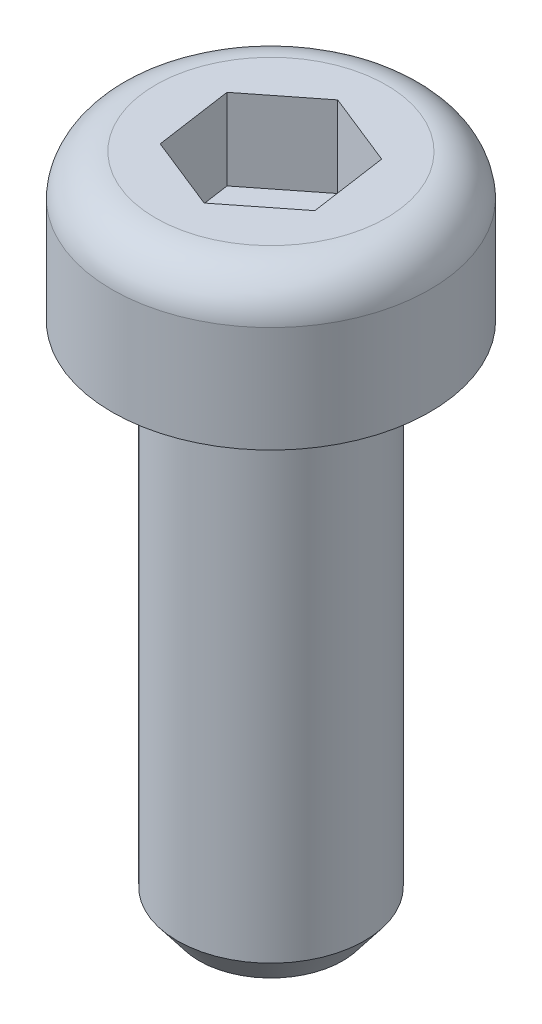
ISO-10303-21;
HEADER;
FILE_DESCRIPTION(('STEP AP214'),'2;1');
FILE_NAME('part.step','',(''),(''),'','','');
FILE_SCHEMA(('AUTOMOTIVE_DESIGN { 1 0 10303 214 1 1 1 1 }'));
ENDSEC;
DATA;
#1=APPLICATION_CONTEXT('core data for automotive mechanical design processes');
#2=APPLICATION_PROTOCOL_DEFINITION('international standard','automotive_design',2000,#1);
#3=PRODUCT_CONTEXT('',#1,'mechanical');
#4=PRODUCT('Part','Part','',(#3));
#5=PRODUCT_RELATED_PRODUCT_CATEGORY('part','',(#4));
#6=PRODUCT_DEFINITION_FORMATION('','',#4);
#7=PRODUCT_DEFINITION_CONTEXT('part definition',#1,'design');
#8=PRODUCT_DEFINITION('design','',#6,#7);
#9=PRODUCT_DEFINITION_SHAPE('','',#8);
#10=(LENGTH_UNIT() NAMED_UNIT(*) SI_UNIT(.MILLI.,.METRE.));
#11=(NAMED_UNIT(*) PLANE_ANGLE_UNIT() SI_UNIT($,.RADIAN.));
#12=(NAMED_UNIT(*) SI_UNIT($,.STERADIAN.) SOLID_ANGLE_UNIT());
#13=UNCERTAINTY_MEASURE_WITH_UNIT(LENGTH_MEASURE(1.E-05),#10,'distance_accuracy_value','');
#14=(GEOMETRIC_REPRESENTATION_CONTEXT(3) GLOBAL_UNCERTAINTY_ASSIGNED_CONTEXT((#13)) GLOBAL_UNIT_ASSIGNED_CONTEXT((#10,
#11,#12)) REPRESENTATION_CONTEXT('',''));
#15=CARTESIAN_POINT('',(0.,0.,0.));
#16=DIRECTION('',(0.,0.,1.));
#17=DIRECTION('',(1.,0.,0.));
#18=AXIS2_PLACEMENT_3D('',#15,#16,#17);
#19=CARTESIAN_POINT('',(-4.42696025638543,-31.9873831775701,0.));
#20=DIRECTION('',(0.,-1.,0.));
#21=DIRECTION('',(0.,0.,-1.));
#22=AXIS2_PLACEMENT_3D('',#19,#20,#21);
#23=PLANE('',#22);
#24=CARTESIAN_POINT('',(0.,-31.9873831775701,0.));
#25=DIRECTION('',(0.,1.,0.));
#26=DIRECTION('',(0.,0.,1.));
#27=AXIS2_PLACEMENT_3D('',#24,#25,#26);
#28=CIRCLE('',#27,4.42696025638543);
#29=CARTESIAN_POINT('',(0.,-31.9873831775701,4.42696025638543));
#30=VERTEX_POINT('',#29);
#31=EDGE_CURVE('E140',#30,#30,#28,.T.);
#32=ORIENTED_EDGE('',*,*,#31,.F.);
#33=EDGE_LOOP('',(#32));
#34=FACE_BOUND('',#33,.T.);
#35=ADVANCED_FACE('F33',(#34),#23,.T.);
#36=CARTESIAN_POINT('',(-1.53173837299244,9.01962904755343,0.));
#37=DIRECTION('',(0.,1.,0.));
#38=DIRECTION('',(0.,0.,1.));
#39=AXIS2_PLACEMENT_3D('',#36,#37,#38);
#40=PLANE('',#39);
#41=DIRECTION('',(-0.928499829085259,0.,-0.37133282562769));
#42=VECTOR('',#41,1.);
#43=CARTESIAN_POINT('',(3.82069582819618,9.01962904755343,-3.00682442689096));
#44=LINE('',#43,#42);
#45=CARTESIAN_POINT('',(3.82069582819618,9.01962904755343,-3.00682442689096));
#46=VERTEX_POINT('',#45);
#47=CARTESIAN_POINT('',(-0.693638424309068,9.01962904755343,-4.81223186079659));
#48=VERTEX_POINT('',#47);
#49=EDGE_CURVE('E48',#46,#48,#44,.T.);
#50=ORIENTED_EDGE('',*,*,#49,.F.);
#51=DIRECTION('',(-0.142666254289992,0.,-0.989770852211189));
#52=VECTOR('',#51,1.);
#53=CARTESIAN_POINT('',(4.51433425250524,9.01962904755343,1.80540743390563));
#54=LINE('',#53,#52);
#55=CARTESIAN_POINT('',(4.51433425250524,9.01962904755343,1.80540743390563));
#56=VERTEX_POINT('',#55);
#57=EDGE_CURVE('E131',#56,#46,#54,.T.);
#58=ORIENTED_EDGE('',*,*,#57,.F.);
#59=DIRECTION('',(0.785833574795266,0.,-0.618438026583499));
#60=VECTOR('',#59,1.);
#61=CARTESIAN_POINT('',(0.693638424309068,9.01962904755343,4.81223186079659));
#62=LINE('',#61,#60);
#63=CARTESIAN_POINT('',(0.693638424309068,9.01962904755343,4.81223186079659));
#64=VERTEX_POINT('',#63);
#65=EDGE_CURVE('E129',#64,#56,#62,.T.);
#66=ORIENTED_EDGE('',*,*,#65,.F.);
#67=DIRECTION('',(0.928499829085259,0.,0.37133282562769));
#68=VECTOR('',#67,1.);
#69=CARTESIAN_POINT('',(-3.82069582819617,9.01962904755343,3.00682442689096));
#70=LINE('',#69,#68);
#71=CARTESIAN_POINT('',(-3.82069582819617,9.01962904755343,3.00682442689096));
#72=VERTEX_POINT('',#71);
#73=EDGE_CURVE('E96',#72,#64,#70,.T.);
#74=ORIENTED_EDGE('',*,*,#73,.F.);
#75=DIRECTION('',(0.142666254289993,0.,0.989770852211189));
#76=VECTOR('',#75,1.);
#77=CARTESIAN_POINT('',(-4.51433425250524,9.01962904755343,-1.80540743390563));
#78=LINE('',#77,#76);
#79=CARTESIAN_POINT('',(-4.51433425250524,9.01962904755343,-1.80540743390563));
#80=VERTEX_POINT('',#79);
#81=EDGE_CURVE('E125',#80,#72,#78,.T.);
#82=ORIENTED_EDGE('',*,*,#81,.F.);
#83=DIRECTION('',(-0.785833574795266,0.,0.618438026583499));
#84=VECTOR('',#83,1.);
#85=CARTESIAN_POINT('',(-0.693638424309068,9.01962904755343,-4.81223186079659));
#86=LINE('',#85,#84);
#87=EDGE_CURVE('E122',#48,#80,#86,.T.);
#88=ORIENTED_EDGE('',*,*,#87,.F.);
#89=EDGE_LOOP('',(#50,#58,#66,#74,#82,#88));
#90=FACE_BOUND('',#89,.T.);
#91=CARTESIAN_POINT('',(0.,9.01962904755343,0.));
#92=DIRECTION('',(0.,1.,0.));
#93=DIRECTION('',(0.,0.,1.));
#94=AXIS2_PLACEMENT_3D('',#91,#92,#93);
#95=CIRCLE('',#94,7.11197760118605);
#96=CARTESIAN_POINT('',(0.,9.01962904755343,7.11197760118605));
#97=VERTEX_POINT('',#96);
#98=EDGE_CURVE('E41',#97,#97,#95,.T.);
#99=ORIENTED_EDGE('',*,*,#98,.T.);
#100=EDGE_LOOP('',(#99));
#101=FACE_BOUND('',#100,.T.);
#102=ADVANCED_FACE('F158',(#90,#101),#40,.T.);
#103=CARTESIAN_POINT('',(0.,6.32600587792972,0.));
#104=DIRECTION('',(0.,1.,0.));
#105=DIRECTION('',(0.,0.,1.));
#106=AXIS2_PLACEMENT_3D('',#103,#104,#105);
#107=TOROIDAL_SURFACE('',#106,7.11197760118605,2.6936231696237);
#108=CARTESIAN_POINT('',(0.,6.5411514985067,0.));
#109=DIRECTION('',(0.,1.,0.));
#110=DIRECTION('',(0.,0.,1.));
#111=AXIS2_PLACEMENT_3D('',#108,#109,#110);
#112=CIRCLE('',#111,9.79699494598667);
#113=CARTESIAN_POINT('',(0.,6.5411514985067,9.79699494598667));
#114=VERTEX_POINT('',#113);
#115=EDGE_CURVE('E152',#114,#114,#112,.T.);
#116=ORIENTED_EDGE('',*,*,#115,.T.);
#117=EDGE_LOOP('',(#116));
#118=FACE_BOUND('',#117,.T.);
#119=ORIENTED_EDGE('',*,*,#98,.F.);
#120=EDGE_LOOP('',(#119));
#121=FACE_BOUND('',#120,.T.);
#122=ADVANCED_FACE('F160',(#118,#121),#107,.T.);
#123=CARTESIAN_POINT('',(0.,0.,0.));
#124=DIRECTION('',(0.,1.,0.));
#125=DIRECTION('',(0.,0.,1.));
#126=AXIS2_PLACEMENT_3D('',#123,#124,#125);
#127=CYLINDRICAL_SURFACE('',#126,9.79699494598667);
#128=CARTESIAN_POINT('',(0.,0.,0.));
#129=DIRECTION('',(0.,1.,0.));
#130=DIRECTION('',(0.,0.,1.));
#131=AXIS2_PLACEMENT_3D('',#128,#129,#130);
#132=CIRCLE('',#131,9.79699494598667);
#133=CARTESIAN_POINT('',(0.,0.,9.79699494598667));
#134=VERTEX_POINT('',#133);
#135=EDGE_CURVE('E149',#134,#134,#132,.T.);
#136=ORIENTED_EDGE('',*,*,#135,.T.);
#137=EDGE_LOOP('',(#136));
#138=FACE_BOUND('',#137,.T.);
#139=ORIENTED_EDGE('',*,*,#115,.F.);
#140=EDGE_LOOP('',(#139));
#141=FACE_BOUND('',#140,.T.);
#142=ADVANCED_FACE('F162',(#138,#141),#127,.T.);
#143=CARTESIAN_POINT('',(-9.79699494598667,0.,0.));
#144=DIRECTION('',(0.,-1.,0.));
#145=DIRECTION('',(0.,0.,-1.));
#146=AXIS2_PLACEMENT_3D('',#143,#144,#145);
#147=PLANE('',#146);
#148=CARTESIAN_POINT('',(0.,0.,0.));
#149=DIRECTION('',(0.,1.,0.));
#150=DIRECTION('',(0.,0.,1.));
#151=AXIS2_PLACEMENT_3D('',#148,#149,#150);
#152=CIRCLE('',#151,5.76946892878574);
#153=CARTESIAN_POINT('',(0.,0.,5.76946892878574));
#154=VERTEX_POINT('',#153);
#155=EDGE_CURVE('E146',#154,#154,#152,.T.);
#156=ORIENTED_EDGE('',*,*,#155,.T.);
#157=EDGE_LOOP('',(#156));
#158=FACE_BOUND('',#157,.T.);
#159=ORIENTED_EDGE('',*,*,#135,.F.);
#160=EDGE_LOOP('',(#159));
#161=FACE_BOUND('',#160,.T.);
#162=ADVANCED_FACE('F169',(#158,#161),#147,.T.);
#163=CARTESIAN_POINT('',(0.,0.,0.));
#164=DIRECTION('',(0.,1.,0.));
#165=DIRECTION('',(0.,0.,1.));
#166=AXIS2_PLACEMENT_3D('',#163,#164,#165);
#167=CYLINDRICAL_SURFACE('',#166,5.76946892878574);
#168=CARTESIAN_POINT('',(0.,-30.2465732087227,0.));
#169=DIRECTION('',(0.,1.,0.));
#170=DIRECTION('',(0.,0.,1.));
#171=AXIS2_PLACEMENT_3D('',#168,#169,#170);
#172=CIRCLE('',#171,5.76946892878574);
#173=CARTESIAN_POINT('',(0.,-30.2465732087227,5.76946892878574));
#174=VERTEX_POINT('',#173);
#175=EDGE_CURVE('E143',#174,#174,#172,.T.);
#176=ORIENTED_EDGE('',*,*,#175,.T.);
#177=EDGE_LOOP('',(#176));
#178=FACE_BOUND('',#177,.T.);
#179=ORIENTED_EDGE('',*,*,#155,.F.);
#180=EDGE_LOOP('',(#179));
#181=FACE_BOUND('',#180,.T.);
#182=ADVANCED_FACE('F184',(#178,#181),#167,.T.);
#183=CARTESIAN_POINT('',(0.,-30.2465732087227,0.));
#184=DIRECTION('',(0.,1.,0.));
#185=DIRECTION('',(0.,0.,1.));
#186=AXIS2_PLACEMENT_3D('',#183,#184,#185);
#187=CONICAL_SURFACE('',#186,5.76946892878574,0.656930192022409);
#188=ORIENTED_EDGE('',*,*,#31,.T.);
#189=EDGE_LOOP('',(#188));
#190=FACE_BOUND('',#189,.T.);
#191=ORIENTED_EDGE('',*,*,#175,.F.);
#192=EDGE_LOOP('',(#191));
#193=FACE_BOUND('',#192,.T.);
#194=ADVANCED_FACE('F180',(#190,#193),#187,.T.);
#195=CARTESIAN_POINT('',(3.82069582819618,4.01962904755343,-3.00682442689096));
#196=DIRECTION('',(0.37133282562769,0.,-0.928499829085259));
#197=DIRECTION('',(-0.928499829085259,0.,-0.37133282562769));
#198=AXIS2_PLACEMENT_3D('',#195,#196,#197);
#199=PLANE('',#198);
#200=ORIENTED_EDGE('',*,*,#49,.T.);
#201=DIRECTION('',(0.,1.,0.));
#202=VECTOR('',#201,1.);
#203=CARTESIAN_POINT('',(-0.693638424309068,4.01962904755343,-4.81223186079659));
#204=LINE('',#203,#202);
#205=CARTESIAN_POINT('',(-0.693638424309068,4.01962904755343,-4.81223186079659));
#206=VERTEX_POINT('',#205);
#207=EDGE_CURVE('E78',#206,#48,#204,.T.);
#208=ORIENTED_EDGE('',*,*,#207,.F.);
#209=DIRECTION('',(-0.928499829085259,0.,-0.37133282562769));
#210=VECTOR('',#209,1.);
#211=CARTESIAN_POINT('',(3.82069582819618,4.01962904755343,-3.00682442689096));
#212=LINE('',#211,#210);
#213=CARTESIAN_POINT('',(3.82069582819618,4.01962904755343,-3.00682442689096));
#214=VERTEX_POINT('',#213);
#215=EDGE_CURVE('E133',#214,#206,#212,.T.);
#216=ORIENTED_EDGE('',*,*,#215,.F.);
#217=DIRECTION('',(0.,1.,0.));
#218=VECTOR('',#217,1.);
#219=CARTESIAN_POINT('',(3.82069582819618,4.01962904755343,-3.00682442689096));
#220=LINE('',#219,#218);
#221=EDGE_CURVE('E56',#214,#46,#220,.T.);
#222=ORIENTED_EDGE('',*,*,#221,.T.);
#223=EDGE_LOOP('',(#200,#208,#216,#222));
#224=FACE_BOUND('',#223,.T.);
#225=ADVANCED_FACE('F183',(#224),#199,.F.);
#226=CARTESIAN_POINT('',(4.51433425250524,4.01962904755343,1.80540743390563));
#227=DIRECTION('',(0.989770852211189,0.,-0.142666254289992));
#228=DIRECTION('',(-0.142666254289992,0.,-0.989770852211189));
#229=AXIS2_PLACEMENT_3D('',#226,#227,#228);
#230=PLANE('',#229);
#231=ORIENTED_EDGE('',*,*,#57,.T.);
#232=ORIENTED_EDGE('',*,*,#221,.F.);
#233=DIRECTION('',(-0.142666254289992,0.,-0.989770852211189));
#234=VECTOR('',#233,1.);
#235=CARTESIAN_POINT('',(4.51433425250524,4.01962904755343,1.80540743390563));
#236=LINE('',#235,#234);
#237=CARTESIAN_POINT('',(4.51433425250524,4.01962904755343,1.80540743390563));
#238=VERTEX_POINT('',#237);
#239=EDGE_CURVE('E108',#238,#214,#236,.T.);
#240=ORIENTED_EDGE('',*,*,#239,.F.);
#241=DIRECTION('',(0.,1.,0.));
#242=VECTOR('',#241,1.);
#243=CARTESIAN_POINT('',(4.51433425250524,4.01962904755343,1.80540743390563));
#244=LINE('',#243,#242);
#245=EDGE_CURVE('E100',#238,#56,#244,.T.);
#246=ORIENTED_EDGE('',*,*,#245,.T.);
#247=EDGE_LOOP('',(#231,#232,#240,#246));
#248=FACE_BOUND('',#247,.T.);
#249=ADVANCED_FACE('F204',(#248),#230,.F.);
#250=CARTESIAN_POINT('',(0.693638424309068,4.01962904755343,4.81223186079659));
#251=DIRECTION('',(0.618438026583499,0.,0.785833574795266));
#252=DIRECTION('',(0.785833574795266,0.,-0.618438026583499));
#253=AXIS2_PLACEMENT_3D('',#250,#251,#252);
#254=PLANE('',#253);
#255=ORIENTED_EDGE('',*,*,#65,.T.);
#256=ORIENTED_EDGE('',*,*,#245,.F.);
#257=DIRECTION('',(0.785833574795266,0.,-0.618438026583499));
#258=VECTOR('',#257,1.);
#259=CARTESIAN_POINT('',(0.693638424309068,4.01962904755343,4.81223186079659));
#260=LINE('',#259,#258);
#261=CARTESIAN_POINT('',(0.693638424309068,4.01962904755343,4.81223186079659));
#262=VERTEX_POINT('',#261);
#263=EDGE_CURVE('E104',#262,#238,#260,.T.);
#264=ORIENTED_EDGE('',*,*,#263,.F.);
#265=DIRECTION('',(0.,1.,0.));
#266=VECTOR('',#265,1.);
#267=CARTESIAN_POINT('',(0.693638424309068,4.01962904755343,4.81223186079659));
#268=LINE('',#267,#266);
#269=EDGE_CURVE('E89',#262,#64,#268,.T.);
#270=ORIENTED_EDGE('',*,*,#269,.T.);
#271=EDGE_LOOP('',(#255,#256,#264,#270));
#272=FACE_BOUND('',#271,.T.);
#273=ADVANCED_FACE('F105',(#272),#254,.F.);
#274=CARTESIAN_POINT('',(-3.82069582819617,4.01962904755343,3.00682442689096));
#275=DIRECTION('',(-0.37133282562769,0.,0.928499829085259));
#276=DIRECTION('',(0.928499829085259,0.,0.37133282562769));
#277=AXIS2_PLACEMENT_3D('',#274,#275,#276);
#278=PLANE('',#277);
#279=ORIENTED_EDGE('',*,*,#73,.T.);
#280=ORIENTED_EDGE('',*,*,#269,.F.);
#281=DIRECTION('',(0.928499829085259,0.,0.37133282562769));
#282=VECTOR('',#281,1.);
#283=CARTESIAN_POINT('',(-3.82069582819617,4.01962904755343,3.00682442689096));
#284=LINE('',#283,#282);
#285=CARTESIAN_POINT('',(-3.82069582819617,4.01962904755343,3.00682442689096));
#286=VERTEX_POINT('',#285);
#287=EDGE_CURVE('E93',#286,#262,#284,.T.);
#288=ORIENTED_EDGE('',*,*,#287,.F.);
#289=DIRECTION('',(0.,1.,0.));
#290=VECTOR('',#289,1.);
#291=CARTESIAN_POINT('',(-3.82069582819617,4.01962904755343,3.00682442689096));
#292=LINE('',#291,#290);
#293=EDGE_CURVE('E101',#286,#72,#292,.T.);
#294=ORIENTED_EDGE('',*,*,#293,.T.);
#295=EDGE_LOOP('',(#279,#280,#288,#294));
#296=FACE_BOUND('',#295,.T.);
#297=ADVANCED_FACE('F91',(#296),#278,.F.);
#298=CARTESIAN_POINT('',(-4.51433425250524,4.01962904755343,-1.80540743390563));
#299=DIRECTION('',(-0.989770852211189,0.,0.142666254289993));
#300=DIRECTION('',(0.142666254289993,0.,0.989770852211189));
#301=AXIS2_PLACEMENT_3D('',#298,#299,#300);
#302=PLANE('',#301);
#303=ORIENTED_EDGE('',*,*,#81,.T.);
#304=ORIENTED_EDGE('',*,*,#293,.F.);
#305=DIRECTION('',(0.142666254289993,0.,0.989770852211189));
#306=VECTOR('',#305,1.);
#307=CARTESIAN_POINT('',(-4.51433425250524,4.01962904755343,-1.80540743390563));
#308=LINE('',#307,#306);
#309=CARTESIAN_POINT('',(-4.51433425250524,4.01962904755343,-1.80540743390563));
#310=VERTEX_POINT('',#309);
#311=EDGE_CURVE('E114',#310,#286,#308,.T.);
#312=ORIENTED_EDGE('',*,*,#311,.F.);
#313=DIRECTION('',(0.,1.,0.));
#314=VECTOR('',#313,1.);
#315=CARTESIAN_POINT('',(-4.51433425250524,4.01962904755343,-1.80540743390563));
#316=LINE('',#315,#314);
#317=EDGE_CURVE('E137',#310,#80,#316,.T.);
#318=ORIENTED_EDGE('',*,*,#317,.T.);
#319=EDGE_LOOP('',(#303,#304,#312,#318));
#320=FACE_BOUND('',#319,.T.);
#321=ADVANCED_FACE('F208',(#320),#302,.F.);
#322=CARTESIAN_POINT('',(-0.693638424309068,4.01962904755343,-4.81223186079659));
#323=DIRECTION('',(-0.618438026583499,0.,-0.785833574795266));
#324=DIRECTION('',(-0.785833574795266,0.,0.618438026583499));
#325=AXIS2_PLACEMENT_3D('',#322,#323,#324);
#326=PLANE('',#325);
#327=ORIENTED_EDGE('',*,*,#87,.T.);
#328=ORIENTED_EDGE('',*,*,#317,.F.);
#329=DIRECTION('',(-0.785833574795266,0.,0.618438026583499));
#330=VECTOR('',#329,1.);
#331=CARTESIAN_POINT('',(-0.693638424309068,4.01962904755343,-4.81223186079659));
#332=LINE('',#331,#330);
#333=EDGE_CURVE('E116',#206,#310,#332,.T.);
#334=ORIENTED_EDGE('',*,*,#333,.F.);
#335=ORIENTED_EDGE('',*,*,#207,.T.);
#336=EDGE_LOOP('',(#327,#328,#334,#335));
#337=FACE_BOUND('',#336,.T.);
#338=ADVANCED_FACE('F205',(#337),#326,.F.);
#339=CARTESIAN_POINT('',(3.82069582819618,4.01962904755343,-3.00682442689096));
#340=DIRECTION('',(0.,-1.,0.));
#341=DIRECTION('',(0.,0.,-1.));
#342=AXIS2_PLACEMENT_3D('',#339,#340,#341);
#343=PLANE('',#342);
#344=CARTESIAN_POINT('',(0.,4.01962904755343,0.));
#345=DIRECTION('',(0.,-1.,0.));
#346=DIRECTION('',(0.,0.,-1.));
#347=AXIS2_PLACEMENT_3D('',#344,#345,#346);
#348=CIRCLE('',#347,1.53173837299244);
#349=CARTESIAN_POINT('',(0.,4.01962904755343,-1.53173837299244));
#350=VERTEX_POINT('',#349);
#351=EDGE_CURVE('E36',#350,#350,#348,.T.);
#352=ORIENTED_EDGE('',*,*,#351,.T.);
#353=EDGE_LOOP('',(#352));
#354=FACE_BOUND('',#353,.T.);
#355=ORIENTED_EDGE('',*,*,#215,.T.);
#356=ORIENTED_EDGE('',*,*,#333,.T.);
#357=ORIENTED_EDGE('',*,*,#311,.T.);
#358=ORIENTED_EDGE('',*,*,#287,.T.);
#359=ORIENTED_EDGE('',*,*,#263,.T.);
#360=ORIENTED_EDGE('',*,*,#239,.T.);
#361=EDGE_LOOP('',(#355,#356,#357,#358,#359,#360));
#362=FACE_BOUND('',#361,.T.);
#363=ADVANCED_FACE('F111',(#354,#362),#343,.F.);
#364=CARTESIAN_POINT('',(0.,1.46465007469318,0.));
#365=DIRECTION('',(0.,1.,0.));
#366=DIRECTION('',(0.,0.,1.));
#367=AXIS2_PLACEMENT_3D('',#364,#365,#366);
#368=PLANE('',#367);
#369=CARTESIAN_POINT('',(0.,1.46465007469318,0.));
#370=DIRECTION('',(0.,1.,0.));
#371=DIRECTION('',(0.,0.,1.));
#372=AXIS2_PLACEMENT_3D('',#369,#370,#371);
#373=CIRCLE('',#372,1.53173837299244);
#374=CARTESIAN_POINT('',(0.,1.46465007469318,1.53173837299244));
#375=VERTEX_POINT('',#374);
#376=EDGE_CURVE('E11',#375,#375,#373,.T.);
#377=ORIENTED_EDGE('',*,*,#376,.T.);
#378=EDGE_LOOP('',(#377));
#379=FACE_BOUND('',#378,.T.);
#380=ADVANCED_FACE('F220',(#379),#368,.T.);
#381=CARTESIAN_POINT('',(0.,0.,0.));
#382=DIRECTION('',(0.,1.,0.));
#383=DIRECTION('',(0.,0.,1.));
#384=AXIS2_PLACEMENT_3D('',#381,#382,#383);
#385=CYLINDRICAL_SURFACE('',#384,1.53173837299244);
#386=ORIENTED_EDGE('',*,*,#351,.F.);
#387=EDGE_LOOP('',(#386));
#388=FACE_BOUND('',#387,.T.);
#389=ORIENTED_EDGE('',*,*,#376,.F.);
#390=EDGE_LOOP('',(#389));
#391=FACE_BOUND('',#390,.T.);
#392=ADVANCED_FACE('F225',(#388,#391),#385,.F.);
#393=CLOSED_SHELL('',(#35,#102,#122,#142,#162,#182,#194,#225,#249,#273,#297,#321,#338,#363,#380,#392));
#394=MANIFOLD_SOLID_BREP('B2',#393);
#395=ADVANCED_BREP_SHAPE_REPRESENTATION('',(#18,#394),#14);
#396=SHAPE_DEFINITION_REPRESENTATION(#9,#395);
ENDSEC;
END-ISO-10303-21;
